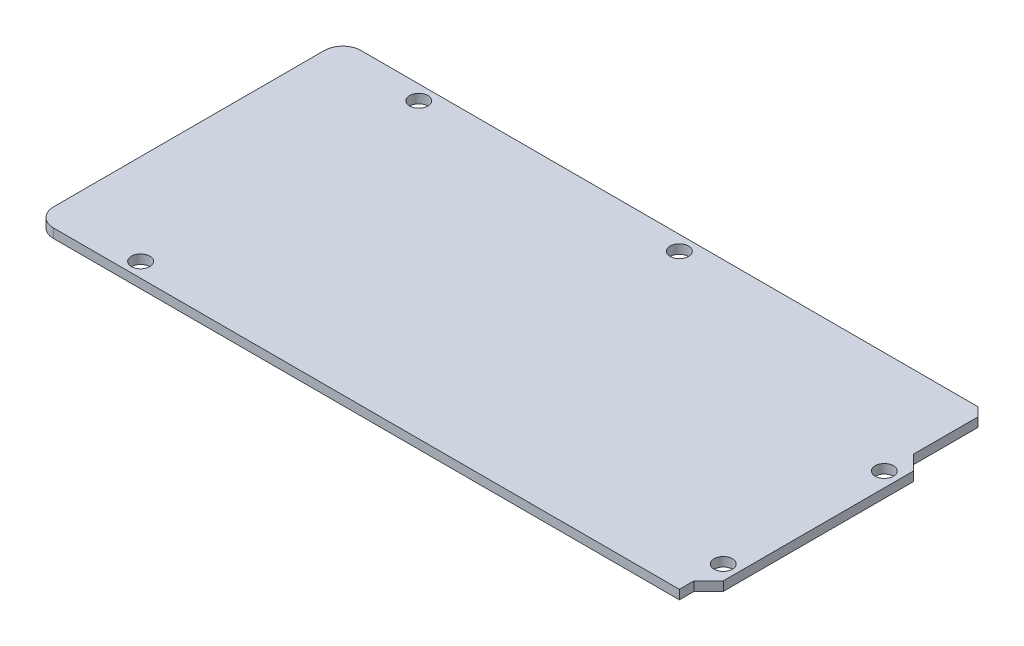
ISO-10303-21;
HEADER;
FILE_DESCRIPTION(('STEP AP214'),'2;1');
FILE_NAME('part.step','',(''),(''),'','','');
FILE_SCHEMA(('AUTOMOTIVE_DESIGN { 1 0 10303 214 1 1 1 1 }'));
ENDSEC;
DATA;
#1=APPLICATION_CONTEXT('core data for automotive mechanical design processes');
#2=APPLICATION_PROTOCOL_DEFINITION('international standard','automotive_design',2000,#1);
#3=PRODUCT_CONTEXT('',#1,'mechanical');
#4=PRODUCT('Part','Part','',(#3));
#5=PRODUCT_RELATED_PRODUCT_CATEGORY('part','',(#4));
#6=PRODUCT_DEFINITION_FORMATION('','',#4);
#7=PRODUCT_DEFINITION_CONTEXT('part definition',#1,'design');
#8=PRODUCT_DEFINITION('design','',#6,#7);
#9=PRODUCT_DEFINITION_SHAPE('','',#8);
#10=(LENGTH_UNIT() NAMED_UNIT(*) SI_UNIT(.MILLI.,.METRE.));
#11=(NAMED_UNIT(*) PLANE_ANGLE_UNIT() SI_UNIT($,.RADIAN.));
#12=(NAMED_UNIT(*) SI_UNIT($,.STERADIAN.) SOLID_ANGLE_UNIT());
#13=UNCERTAINTY_MEASURE_WITH_UNIT(LENGTH_MEASURE(1.E-05),#10,'distance_accuracy_value','');
#14=(GEOMETRIC_REPRESENTATION_CONTEXT(3) GLOBAL_UNCERTAINTY_ASSIGNED_CONTEXT((#13)) GLOBAL_UNIT_ASSIGNED_CONTEXT((#10,
#11,#12)) REPRESENTATION_CONTEXT('',''));
#15=CARTESIAN_POINT('',(0.,0.,0.));
#16=DIRECTION('',(0.,0.,1.));
#17=DIRECTION('',(1.,0.,0.));
#18=AXIS2_PLACEMENT_3D('',#15,#16,#17);
#19=CARTESIAN_POINT('',(3.175,1.5875,-3.175));
#20=DIRECTION('',(0.,-1.,0.));
#21=DIRECTION('',(0.,0.,-1.));
#22=AXIS2_PLACEMENT_3D('',#19,#20,#21);
#23=CYLINDRICAL_SURFACE('',#22,3.175);
#24=CARTESIAN_POINT('',(3.175,0.,-3.175));
#25=DIRECTION('',(0.,1.,0.));
#26=DIRECTION('',(0.,0.,-1.));
#27=AXIS2_PLACEMENT_3D('',#24,#25,#26);
#28=CIRCLE('',#27,3.175);
#29=CARTESIAN_POINT('',(0.,0.,-3.17500000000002));
#30=VERTEX_POINT('',#29);
#31=CARTESIAN_POINT('',(3.17500000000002,0.,0.));
#32=VERTEX_POINT('',#31);
#33=EDGE_CURVE('E145',#30,#32,#28,.T.);
#34=ORIENTED_EDGE('',*,*,#33,.T.);
#35=DIRECTION('',(0.,-1.,0.));
#36=VECTOR('',#35,1.);
#37=CARTESIAN_POINT('',(3.17500000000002,1.5875,0.));
#38=LINE('',#37,#36);
#39=CARTESIAN_POINT('',(3.17500000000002,1.5875,0.));
#40=VERTEX_POINT('',#39);
#41=EDGE_CURVE('E11',#40,#32,#38,.T.);
#42=ORIENTED_EDGE('',*,*,#41,.F.);
#43=CARTESIAN_POINT('',(3.175,1.5875,-3.175));
#44=DIRECTION('',(0.,1.,0.));
#45=DIRECTION('',(0.,0.,-1.));
#46=AXIS2_PLACEMENT_3D('',#43,#44,#45);
#47=CIRCLE('',#46,3.175);
#48=CARTESIAN_POINT('',(0.,1.5875,-3.17500000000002));
#49=VERTEX_POINT('',#48);
#50=EDGE_CURVE('E166',#49,#40,#47,.T.);
#51=ORIENTED_EDGE('',*,*,#50,.F.);
#52=DIRECTION('',(0.,-1.,0.));
#53=VECTOR('',#52,1.);
#54=CARTESIAN_POINT('',(0.,1.5875,-3.17500000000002));
#55=LINE('',#54,#53);
#56=EDGE_CURVE('E141',#49,#30,#55,.T.);
#57=ORIENTED_EDGE('',*,*,#56,.T.);
#58=EDGE_LOOP('',(#34,#42,#51,#57));
#59=FACE_BOUND('',#58,.T.);
#60=ADVANCED_FACE('F31',(#59),#23,.T.);
#61=CARTESIAN_POINT('',(3.17500000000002,1.5875,0.));
#62=DIRECTION('',(0.,0.,-1.));
#63=DIRECTION('',(-1.,0.,0.));
#64=AXIS2_PLACEMENT_3D('',#61,#62,#63);
#65=PLANE('',#64);
#66=DIRECTION('',(1.,0.,0.));
#67=VECTOR('',#66,1.);
#68=CARTESIAN_POINT('',(3.17500000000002,0.,0.));
#69=LINE('',#68,#67);
#70=CARTESIAN_POINT('',(111.76,0.,0.));
#71=VERTEX_POINT('',#70);
#72=EDGE_CURVE('E148',#32,#71,#69,.T.);
#73=ORIENTED_EDGE('',*,*,#72,.T.);
#74=DIRECTION('',(0.,-1.,0.));
#75=VECTOR('',#74,1.);
#76=CARTESIAN_POINT('',(111.76,1.5875,0.));
#77=LINE('',#76,#75);
#78=CARTESIAN_POINT('',(111.76,1.5875,0.));
#79=VERTEX_POINT('',#78);
#80=EDGE_CURVE('E39',#79,#71,#77,.T.);
#81=ORIENTED_EDGE('',*,*,#80,.F.);
#82=DIRECTION('',(1.,0.,0.));
#83=VECTOR('',#82,1.);
#84=CARTESIAN_POINT('',(3.17500000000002,1.5875,0.));
#85=LINE('',#84,#83);
#86=EDGE_CURVE('E99',#40,#79,#85,.T.);
#87=ORIENTED_EDGE('',*,*,#86,.F.);
#88=ORIENTED_EDGE('',*,*,#41,.T.);
#89=EDGE_LOOP('',(#73,#81,#87,#88));
#90=FACE_BOUND('',#89,.T.);
#91=ADVANCED_FACE('F239',(#90),#65,.F.);
#92=CARTESIAN_POINT('',(111.76,1.5875,0.));
#93=DIRECTION('',(-1.,0.,0.));
#94=DIRECTION('',(0.,0.,1.));
#95=AXIS2_PLACEMENT_3D('',#92,#93,#94);
#96=PLANE('',#95);
#97=DIRECTION('',(0.,0.,-1.));
#98=VECTOR('',#97,1.);
#99=CARTESIAN_POINT('',(111.76,0.,0.));
#100=LINE('',#99,#98);
#101=CARTESIAN_POINT('',(111.76,0.,-2.54));
#102=VERTEX_POINT('',#101);
#103=EDGE_CURVE('E151',#71,#102,#100,.T.);
#104=ORIENTED_EDGE('',*,*,#103,.T.);
#105=DIRECTION('',(0.,-1.,0.));
#106=VECTOR('',#105,1.);
#107=CARTESIAN_POINT('',(111.76,1.5875,-2.54));
#108=LINE('',#107,#106);
#109=CARTESIAN_POINT('',(111.76,1.5875,-2.54));
#110=VERTEX_POINT('',#109);
#111=EDGE_CURVE('E182',#110,#102,#108,.T.);
#112=ORIENTED_EDGE('',*,*,#111,.F.);
#113=DIRECTION('',(0.,0.,-1.));
#114=VECTOR('',#113,1.);
#115=CARTESIAN_POINT('',(111.76,1.5875,0.));
#116=LINE('',#115,#114);
#117=EDGE_CURVE('E190',#79,#110,#116,.T.);
#118=ORIENTED_EDGE('',*,*,#117,.F.);
#119=ORIENTED_EDGE('',*,*,#80,.T.);
#120=EDGE_LOOP('',(#104,#112,#118,#119));
#121=FACE_BOUND('',#120,.T.);
#122=ADVANCED_FACE('F188',(#121),#96,.F.);
#123=CARTESIAN_POINT('',(111.76,1.5875,-2.54));
#124=DIRECTION('',(-0.707106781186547,0.,-0.707106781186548));
#125=DIRECTION('',(-0.707106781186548,0.,0.707106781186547));
#126=AXIS2_PLACEMENT_3D('',#123,#124,#125);
#127=PLANE('',#126);
#128=DIRECTION('',(0.707106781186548,0.,-0.707106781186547));
#129=VECTOR('',#128,1.);
#130=CARTESIAN_POINT('',(111.76,0.,-2.54));
#131=LINE('',#130,#129);
#132=CARTESIAN_POINT('',(114.3,0.,-5.08));
#133=VERTEX_POINT('',#132);
#134=EDGE_CURVE('E153',#102,#133,#131,.T.);
#135=ORIENTED_EDGE('',*,*,#134,.T.);
#136=DIRECTION('',(0.,-1.,0.));
#137=VECTOR('',#136,1.);
#138=CARTESIAN_POINT('',(114.3,1.5875,-5.08));
#139=LINE('',#138,#137);
#140=CARTESIAN_POINT('',(114.3,1.5875,-5.08));
#141=VERTEX_POINT('',#140);
#142=EDGE_CURVE('E179',#141,#133,#139,.T.);
#143=ORIENTED_EDGE('',*,*,#142,.F.);
#144=DIRECTION('',(0.707106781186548,0.,-0.707106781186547));
#145=VECTOR('',#144,1.);
#146=CARTESIAN_POINT('',(111.76,1.5875,-2.54));
#147=LINE('',#146,#145);
#148=EDGE_CURVE('E208',#110,#141,#147,.T.);
#149=ORIENTED_EDGE('',*,*,#148,.F.);
#150=ORIENTED_EDGE('',*,*,#111,.T.);
#151=EDGE_LOOP('',(#135,#143,#149,#150));
#152=FACE_BOUND('',#151,.T.);
#153=ADVANCED_FACE('F199',(#152),#127,.F.);
#154=CARTESIAN_POINT('',(114.3,1.5875,-5.08));
#155=DIRECTION('',(-1.,0.,0.));
#156=DIRECTION('',(0.,0.,1.));
#157=AXIS2_PLACEMENT_3D('',#154,#155,#156);
#158=PLANE('',#157);
#159=DIRECTION('',(0.,0.,-1.));
#160=VECTOR('',#159,1.);
#161=CARTESIAN_POINT('',(114.3,0.,-5.08));
#162=LINE('',#161,#160);
#163=CARTESIAN_POINT('',(114.3,0.,-38.1));
#164=VERTEX_POINT('',#163);
#165=EDGE_CURVE('E155',#133,#164,#162,.T.);
#166=ORIENTED_EDGE('',*,*,#165,.T.);
#167=DIRECTION('',(0.,-1.,0.));
#168=VECTOR('',#167,1.);
#169=CARTESIAN_POINT('',(114.3,1.5875,-38.1));
#170=LINE('',#169,#168);
#171=CARTESIAN_POINT('',(114.3,1.5875,-38.1));
#172=VERTEX_POINT('',#171);
#173=EDGE_CURVE('E176',#172,#164,#170,.T.);
#174=ORIENTED_EDGE('',*,*,#173,.F.);
#175=DIRECTION('',(0.,0.,-1.));
#176=VECTOR('',#175,1.);
#177=CARTESIAN_POINT('',(114.3,1.5875,-5.08));
#178=LINE('',#177,#176);
#179=EDGE_CURVE('E205',#141,#172,#178,.T.);
#180=ORIENTED_EDGE('',*,*,#179,.F.);
#181=ORIENTED_EDGE('',*,*,#142,.T.);
#182=EDGE_LOOP('',(#166,#174,#180,#181));
#183=FACE_BOUND('',#182,.T.);
#184=ADVANCED_FACE('F203',(#183),#158,.F.);
#185=CARTESIAN_POINT('',(114.3,1.5875,-38.1));
#186=DIRECTION('',(-0.707106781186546,0.,0.707106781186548));
#187=DIRECTION('',(0.707106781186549,0.,0.707106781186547));
#188=AXIS2_PLACEMENT_3D('',#185,#186,#187);
#189=PLANE('',#188);
#190=DIRECTION('',(-0.707106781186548,0.,-0.707106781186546));
#191=VECTOR('',#190,1.);
#192=CARTESIAN_POINT('',(114.3,0.,-38.1));
#193=LINE('',#192,#191);
#194=CARTESIAN_POINT('',(111.76,0.,-40.64));
#195=VERTEX_POINT('',#194);
#196=EDGE_CURVE('E157',#164,#195,#193,.T.);
#197=ORIENTED_EDGE('',*,*,#196,.T.);
#198=DIRECTION('',(0.,-1.,0.));
#199=VECTOR('',#198,1.);
#200=CARTESIAN_POINT('',(111.76,1.5875,-40.64));
#201=LINE('',#200,#199);
#202=CARTESIAN_POINT('',(111.76,1.5875,-40.64));
#203=VERTEX_POINT('',#202);
#204=EDGE_CURVE('E173',#203,#195,#201,.T.);
#205=ORIENTED_EDGE('',*,*,#204,.F.);
#206=DIRECTION('',(-0.707106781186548,0.,-0.707106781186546));
#207=VECTOR('',#206,1.);
#208=CARTESIAN_POINT('',(114.3,1.5875,-38.1));
#209=LINE('',#208,#207);
#210=EDGE_CURVE('E207',#172,#203,#209,.T.);
#211=ORIENTED_EDGE('',*,*,#210,.F.);
#212=ORIENTED_EDGE('',*,*,#173,.T.);
#213=EDGE_LOOP('',(#197,#205,#211,#212));
#214=FACE_BOUND('',#213,.T.);
#215=ADVANCED_FACE('F252',(#214),#189,.F.);
#216=CARTESIAN_POINT('',(111.76,1.5875,-40.64));
#217=DIRECTION('',(-1.,0.,0.));
#218=DIRECTION('',(0.,0.,1.));
#219=AXIS2_PLACEMENT_3D('',#216,#217,#218);
#220=PLANE('',#219);
#221=DIRECTION('',(0.,0.,-1.));
#222=VECTOR('',#221,1.);
#223=CARTESIAN_POINT('',(111.76,0.,-40.64));
#224=LINE('',#223,#222);
#225=CARTESIAN_POINT('',(111.76,0.,-51.816));
#226=VERTEX_POINT('',#225);
#227=EDGE_CURVE('E159',#195,#226,#224,.T.);
#228=ORIENTED_EDGE('',*,*,#227,.T.);
#229=DIRECTION('',(0.,-1.,0.));
#230=VECTOR('',#229,1.);
#231=CARTESIAN_POINT('',(111.76,1.5875,-51.816));
#232=LINE('',#231,#230);
#233=CARTESIAN_POINT('',(111.76,1.5875,-51.816));
#234=VERTEX_POINT('',#233);
#235=EDGE_CURVE('E170',#234,#226,#232,.T.);
#236=ORIENTED_EDGE('',*,*,#235,.F.);
#237=DIRECTION('',(0.,0.,-1.));
#238=VECTOR('',#237,1.);
#239=CARTESIAN_POINT('',(111.76,1.5875,-40.64));
#240=LINE('',#239,#238);
#241=EDGE_CURVE('E210',#203,#234,#240,.T.);
#242=ORIENTED_EDGE('',*,*,#241,.F.);
#243=ORIENTED_EDGE('',*,*,#204,.T.);
#244=EDGE_LOOP('',(#228,#236,#242,#243));
#245=FACE_BOUND('',#244,.T.);
#246=ADVANCED_FACE('F219',(#245),#220,.F.);
#247=CARTESIAN_POINT('',(111.76,1.5875,-51.816));
#248=DIRECTION('',(-0.707106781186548,0.,0.707106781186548));
#249=DIRECTION('',(0.707106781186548,0.,0.707106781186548));
#250=AXIS2_PLACEMENT_3D('',#247,#248,#249);
#251=PLANE('',#250);
#252=DIRECTION('',(-0.707106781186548,0.,-0.707106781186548));
#253=VECTOR('',#252,1.);
#254=CARTESIAN_POINT('',(111.76,0.,-51.816));
#255=LINE('',#254,#253);
#256=CARTESIAN_POINT('',(110.236,0.,-53.34));
#257=VERTEX_POINT('',#256);
#258=EDGE_CURVE('E161',#226,#257,#255,.T.);
#259=ORIENTED_EDGE('',*,*,#258,.T.);
#260=DIRECTION('',(0.,-1.,0.));
#261=VECTOR('',#260,1.);
#262=CARTESIAN_POINT('',(110.236,1.5875,-53.34));
#263=LINE('',#262,#261);
#264=CARTESIAN_POINT('',(110.236,1.5875,-53.34));
#265=VERTEX_POINT('',#264);
#266=EDGE_CURVE('E136',#265,#257,#263,.T.);
#267=ORIENTED_EDGE('',*,*,#266,.F.);
#268=DIRECTION('',(-0.707106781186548,0.,-0.707106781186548));
#269=VECTOR('',#268,1.);
#270=CARTESIAN_POINT('',(111.76,1.5875,-51.816));
#271=LINE('',#270,#269);
#272=EDGE_CURVE('E127',#234,#265,#271,.T.);
#273=ORIENTED_EDGE('',*,*,#272,.F.);
#274=ORIENTED_EDGE('',*,*,#235,.T.);
#275=EDGE_LOOP('',(#259,#267,#273,#274));
#276=FACE_BOUND('',#275,.T.);
#277=ADVANCED_FACE('F223',(#276),#251,.F.);
#278=CARTESIAN_POINT('',(3.17500000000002,1.5875,-53.34));
#279=DIRECTION('',(0.,0.,1.));
#280=DIRECTION('',(1.,0.,0.));
#281=AXIS2_PLACEMENT_3D('',#278,#279,#280);
#282=PLANE('',#281);
#283=DIRECTION('',(-1.,0.,0.));
#284=VECTOR('',#283,1.);
#285=CARTESIAN_POINT('',(3.17500000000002,0.,-53.34));
#286=LINE('',#285,#284);
#287=CARTESIAN_POINT('',(3.17500000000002,0.,-53.34));
#288=VERTEX_POINT('',#287);
#289=EDGE_CURVE('E135',#257,#288,#286,.T.);
#290=ORIENTED_EDGE('',*,*,#289,.T.);
#291=DIRECTION('',(0.,-1.,0.));
#292=VECTOR('',#291,1.);
#293=CARTESIAN_POINT('',(3.17500000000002,1.5875,-53.34));
#294=LINE('',#293,#292);
#295=CARTESIAN_POINT('',(3.17500000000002,1.5875,-53.34));
#296=VERTEX_POINT('',#295);
#297=EDGE_CURVE('E132',#296,#288,#294,.T.);
#298=ORIENTED_EDGE('',*,*,#297,.F.);
#299=DIRECTION('',(-1.,0.,0.));
#300=VECTOR('',#299,1.);
#301=CARTESIAN_POINT('',(3.17500000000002,1.5875,-53.34));
#302=LINE('',#301,#300);
#303=EDGE_CURVE('E121',#265,#296,#302,.T.);
#304=ORIENTED_EDGE('',*,*,#303,.F.);
#305=ORIENTED_EDGE('',*,*,#266,.T.);
#306=EDGE_LOOP('',(#290,#298,#304,#305));
#307=FACE_BOUND('',#306,.T.);
#308=ADVANCED_FACE('F133',(#307),#282,.F.);
#309=CARTESIAN_POINT('',(3.175,1.5875,-50.165));
#310=DIRECTION('',(0.,-1.,0.));
#311=DIRECTION('',(0.,0.,-1.));
#312=AXIS2_PLACEMENT_3D('',#309,#310,#311);
#313=CYLINDRICAL_SURFACE('',#312,3.175);
#314=CARTESIAN_POINT('',(3.175,0.,-50.165));
#315=DIRECTION('',(0.,1.,0.));
#316=DIRECTION('',(0.,0.,-1.));
#317=AXIS2_PLACEMENT_3D('',#314,#315,#316);
#318=CIRCLE('',#317,3.175);
#319=CARTESIAN_POINT('',(0.,0.,-50.165));
#320=VERTEX_POINT('',#319);
#321=EDGE_CURVE('E85',#288,#320,#318,.T.);
#322=ORIENTED_EDGE('',*,*,#321,.T.);
#323=DIRECTION('',(0.,-1.,0.));
#324=VECTOR('',#323,1.);
#325=CARTESIAN_POINT('',(0.,1.5875,-50.165));
#326=LINE('',#325,#324);
#327=CARTESIAN_POINT('',(0.,1.5875,-50.165));
#328=VERTEX_POINT('',#327);
#329=EDGE_CURVE('E137',#328,#320,#326,.T.);
#330=ORIENTED_EDGE('',*,*,#329,.F.);
#331=CARTESIAN_POINT('',(3.175,1.5875,-50.165));
#332=DIRECTION('',(0.,1.,0.));
#333=DIRECTION('',(0.,0.,-1.));
#334=AXIS2_PLACEMENT_3D('',#331,#332,#333);
#335=CIRCLE('',#334,3.175);
#336=EDGE_CURVE('E125',#296,#328,#335,.T.);
#337=ORIENTED_EDGE('',*,*,#336,.F.);
#338=ORIENTED_EDGE('',*,*,#297,.T.);
#339=EDGE_LOOP('',(#322,#330,#337,#338));
#340=FACE_BOUND('',#339,.T.);
#341=ADVANCED_FACE('F139',(#340),#313,.T.);
#342=CARTESIAN_POINT('',(0.,1.5875,-3.17500000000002));
#343=DIRECTION('',(1.,0.,0.));
#344=DIRECTION('',(0.,0.,-1.));
#345=AXIS2_PLACEMENT_3D('',#342,#343,#344);
#346=PLANE('',#345);
#347=DIRECTION('',(0.,0.,1.));
#348=VECTOR('',#347,1.);
#349=CARTESIAN_POINT('',(0.,0.,-3.17500000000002));
#350=LINE('',#349,#348);
#351=EDGE_CURVE('E91',#320,#30,#350,.T.);
#352=ORIENTED_EDGE('',*,*,#351,.T.);
#353=ORIENTED_EDGE('',*,*,#56,.F.);
#354=DIRECTION('',(0.,0.,1.));
#355=VECTOR('',#354,1.);
#356=CARTESIAN_POINT('',(0.,1.5875,-3.17500000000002));
#357=LINE('',#356,#355);
#358=EDGE_CURVE('E47',#328,#49,#357,.T.);
#359=ORIENTED_EDGE('',*,*,#358,.F.);
#360=ORIENTED_EDGE('',*,*,#329,.T.);
#361=EDGE_LOOP('',(#352,#353,#359,#360));
#362=FACE_BOUND('',#361,.T.);
#363=ADVANCED_FACE('F227',(#362),#346,.F.);
#364=CARTESIAN_POINT('',(3.175,1.5875,-3.175));
#365=DIRECTION('',(0.,-1.,0.));
#366=DIRECTION('',(0.,0.,-1.));
#367=AXIS2_PLACEMENT_3D('',#364,#365,#366);
#368=PLANE('',#367);
#369=CARTESIAN_POINT('',(15.748,1.5875,-50.8));
#370=DIRECTION('',(0.,1.,0.));
#371=DIRECTION('',(0.,0.,1.));
#372=AXIS2_PLACEMENT_3D('',#369,#370,#371);
#373=CIRCLE('',#372,1.58749999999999);
#374=CARTESIAN_POINT('',(15.748,1.5875,-49.2125));
#375=VERTEX_POINT('',#374);
#376=EDGE_CURVE('E347',#375,#375,#373,.T.);
#377=ORIENTED_EDGE('',*,*,#376,.F.);
#378=EDGE_LOOP('',(#377));
#379=FACE_BOUND('',#378,.T.);
#380=CARTESIAN_POINT('',(15.748,1.5875,-2.54));
#381=DIRECTION('',(0.,1.,0.));
#382=DIRECTION('',(0.,0.,1.));
#383=AXIS2_PLACEMENT_3D('',#380,#381,#382);
#384=CIRCLE('',#383,1.58749999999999);
#385=CARTESIAN_POINT('',(15.748,1.5875,-0.952500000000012));
#386=VERTEX_POINT('',#385);
#387=EDGE_CURVE('E349',#386,#386,#384,.T.);
#388=ORIENTED_EDGE('',*,*,#387,.F.);
#389=EDGE_LOOP('',(#388));
#390=FACE_BOUND('',#389,.T.);
#391=CARTESIAN_POINT('',(60.96,1.5875,-50.8));
#392=DIRECTION('',(0.,1.,0.));
#393=DIRECTION('',(0.,0.,1.));
#394=AXIS2_PLACEMENT_3D('',#391,#392,#393);
#395=CIRCLE('',#394,1.58749999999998);
#396=CARTESIAN_POINT('',(60.96,1.5875,-49.2125));
#397=VERTEX_POINT('',#396);
#398=EDGE_CURVE('E357',#397,#397,#395,.T.);
#399=ORIENTED_EDGE('',*,*,#398,.F.);
#400=EDGE_LOOP('',(#399));
#401=FACE_BOUND('',#400,.T.);
#402=CARTESIAN_POINT('',(111.76,1.5875,-35.56));
#403=DIRECTION('',(0.,1.,0.));
#404=DIRECTION('',(0.,0.,1.));
#405=AXIS2_PLACEMENT_3D('',#402,#403,#404);
#406=CIRCLE('',#405,1.58749999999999);
#407=CARTESIAN_POINT('',(111.76,1.5875,-33.9725));
#408=VERTEX_POINT('',#407);
#409=EDGE_CURVE('E363',#408,#408,#406,.T.);
#410=ORIENTED_EDGE('',*,*,#409,.F.);
#411=EDGE_LOOP('',(#410));
#412=FACE_BOUND('',#411,.T.);
#413=CARTESIAN_POINT('',(111.76,1.5875,-7.62));
#414=DIRECTION('',(0.,1.,0.));
#415=DIRECTION('',(0.,0.,1.));
#416=AXIS2_PLACEMENT_3D('',#413,#414,#415);
#417=CIRCLE('',#416,1.58749999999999);
#418=CARTESIAN_POINT('',(111.76,1.5875,-6.03250000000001));
#419=VERTEX_POINT('',#418);
#420=EDGE_CURVE('E369',#419,#419,#417,.T.);
#421=ORIENTED_EDGE('',*,*,#420,.F.);
#422=EDGE_LOOP('',(#421));
#423=FACE_BOUND('',#422,.T.);
#424=ORIENTED_EDGE('',*,*,#50,.T.);
#425=ORIENTED_EDGE('',*,*,#86,.T.);
#426=ORIENTED_EDGE('',*,*,#117,.T.);
#427=ORIENTED_EDGE('',*,*,#148,.T.);
#428=ORIENTED_EDGE('',*,*,#179,.T.);
#429=ORIENTED_EDGE('',*,*,#210,.T.);
#430=ORIENTED_EDGE('',*,*,#241,.T.);
#431=ORIENTED_EDGE('',*,*,#272,.T.);
#432=ORIENTED_EDGE('',*,*,#303,.T.);
#433=ORIENTED_EDGE('',*,*,#336,.T.);
#434=ORIENTED_EDGE('',*,*,#358,.T.);
#435=EDGE_LOOP('',(#424,#425,#426,#427,#428,#429,#430,#431,#432,#433,#434));
#436=FACE_BOUND('',#435,.T.);
#437=ADVANCED_FACE('F123',(#379,#390,#401,#412,#423,#436),#368,.F.);
#438=CARTESIAN_POINT('',(3.175,0.,-3.175));
#439=DIRECTION('',(0.,-1.,0.));
#440=DIRECTION('',(0.,0.,-1.));
#441=AXIS2_PLACEMENT_3D('',#438,#439,#440);
#442=PLANE('',#441);
#443=CARTESIAN_POINT('',(15.748,0.,-50.8));
#444=DIRECTION('',(0.,1.,0.));
#445=DIRECTION('',(0.,0.,1.));
#446=AXIS2_PLACEMENT_3D('',#443,#444,#445);
#447=CIRCLE('',#446,1.5875);
#448=CARTESIAN_POINT('',(15.748,0.,-49.2125));
#449=VERTEX_POINT('',#448);
#450=EDGE_CURVE('E344',#449,#449,#447,.T.);
#451=ORIENTED_EDGE('',*,*,#450,.T.);
#452=EDGE_LOOP('',(#451));
#453=FACE_BOUND('',#452,.T.);
#454=CARTESIAN_POINT('',(15.748,0.,-2.54));
#455=DIRECTION('',(0.,1.,0.));
#456=DIRECTION('',(0.,0.,1.));
#457=AXIS2_PLACEMENT_3D('',#454,#455,#456);
#458=CIRCLE('',#457,1.5875);
#459=CARTESIAN_POINT('',(15.748,0.,-0.952500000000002));
#460=VERTEX_POINT('',#459);
#461=EDGE_CURVE('E354',#460,#460,#458,.T.);
#462=ORIENTED_EDGE('',*,*,#461,.T.);
#463=EDGE_LOOP('',(#462));
#464=FACE_BOUND('',#463,.T.);
#465=CARTESIAN_POINT('',(60.96,0.,-50.8));
#466=DIRECTION('',(0.,1.,0.));
#467=DIRECTION('',(0.,0.,1.));
#468=AXIS2_PLACEMENT_3D('',#465,#466,#467);
#469=CIRCLE('',#468,1.5875);
#470=CARTESIAN_POINT('',(60.96,0.,-49.2125));
#471=VERTEX_POINT('',#470);
#472=EDGE_CURVE('E360',#471,#471,#469,.T.);
#473=ORIENTED_EDGE('',*,*,#472,.T.);
#474=EDGE_LOOP('',(#473));
#475=FACE_BOUND('',#474,.T.);
#476=CARTESIAN_POINT('',(111.76,0.,-35.56));
#477=DIRECTION('',(0.,1.,0.));
#478=DIRECTION('',(0.,0.,1.));
#479=AXIS2_PLACEMENT_3D('',#476,#477,#478);
#480=CIRCLE('',#479,1.58749999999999);
#481=CARTESIAN_POINT('',(111.76,0.,-33.9725));
#482=VERTEX_POINT('',#481);
#483=EDGE_CURVE('E366',#482,#482,#480,.T.);
#484=ORIENTED_EDGE('',*,*,#483,.T.);
#485=EDGE_LOOP('',(#484));
#486=FACE_BOUND('',#485,.T.);
#487=CARTESIAN_POINT('',(111.76,0.,-7.62));
#488=DIRECTION('',(0.,1.,0.));
#489=DIRECTION('',(0.,0.,1.));
#490=AXIS2_PLACEMENT_3D('',#487,#488,#489);
#491=CIRCLE('',#490,1.58749999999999);
#492=CARTESIAN_POINT('',(111.76,0.,-6.03250000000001));
#493=VERTEX_POINT('',#492);
#494=EDGE_CURVE('E149',#493,#493,#491,.T.);
#495=ORIENTED_EDGE('',*,*,#494,.T.);
#496=EDGE_LOOP('',(#495));
#497=FACE_BOUND('',#496,.T.);
#498=ORIENTED_EDGE('',*,*,#33,.F.);
#499=ORIENTED_EDGE('',*,*,#351,.F.);
#500=ORIENTED_EDGE('',*,*,#321,.F.);
#501=ORIENTED_EDGE('',*,*,#289,.F.);
#502=ORIENTED_EDGE('',*,*,#258,.F.);
#503=ORIENTED_EDGE('',*,*,#227,.F.);
#504=ORIENTED_EDGE('',*,*,#196,.F.);
#505=ORIENTED_EDGE('',*,*,#165,.F.);
#506=ORIENTED_EDGE('',*,*,#134,.F.);
#507=ORIENTED_EDGE('',*,*,#103,.F.);
#508=ORIENTED_EDGE('',*,*,#72,.F.);
#509=EDGE_LOOP('',(#498,#499,#500,#501,#502,#503,#504,#505,#506,#507,#508));
#510=FACE_BOUND('',#509,.T.);
#511=ADVANCED_FACE('F194',(#453,#464,#475,#486,#497,#510),#442,.T.);
#512=CARTESIAN_POINT('',(111.76,1.5875,-7.62));
#513=DIRECTION('',(0.,1.,0.));
#514=DIRECTION('',(0.,0.,1.));
#515=AXIS2_PLACEMENT_3D('',#512,#513,#514);
#516=CYLINDRICAL_SURFACE('',#515,1.58749999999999);
#517=ORIENTED_EDGE('',*,*,#494,.F.);
#518=EDGE_LOOP('',(#517));
#519=FACE_BOUND('',#518,.T.);
#520=ORIENTED_EDGE('',*,*,#420,.T.);
#521=EDGE_LOOP('',(#520));
#522=FACE_BOUND('',#521,.T.);
#523=ADVANCED_FACE('F288',(#519,#522),#516,.F.);
#524=CARTESIAN_POINT('',(111.76,1.5875,-35.56));
#525=DIRECTION('',(0.,1.,0.));
#526=DIRECTION('',(0.,0.,1.));
#527=AXIS2_PLACEMENT_3D('',#524,#525,#526);
#528=CYLINDRICAL_SURFACE('',#527,1.58749999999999);
#529=ORIENTED_EDGE('',*,*,#483,.F.);
#530=EDGE_LOOP('',(#529));
#531=FACE_BOUND('',#530,.T.);
#532=ORIENTED_EDGE('',*,*,#409,.T.);
#533=EDGE_LOOP('',(#532));
#534=FACE_BOUND('',#533,.T.);
#535=ADVANCED_FACE('F297',(#531,#534),#528,.F.);
#536=CARTESIAN_POINT('',(60.96,1.5875,-50.8));
#537=DIRECTION('',(0.,1.,0.));
#538=DIRECTION('',(0.,0.,1.));
#539=AXIS2_PLACEMENT_3D('',#536,#537,#538);
#540=CYLINDRICAL_SURFACE('',#539,1.58749999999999);
#541=ORIENTED_EDGE('',*,*,#472,.F.);
#542=EDGE_LOOP('',(#541));
#543=FACE_BOUND('',#542,.T.);
#544=ORIENTED_EDGE('',*,*,#398,.T.);
#545=EDGE_LOOP('',(#544));
#546=FACE_BOUND('',#545,.T.);
#547=ADVANCED_FACE('F307',(#543,#546),#540,.F.);
#548=CARTESIAN_POINT('',(15.748,1.5875,-2.54));
#549=DIRECTION('',(0.,1.,0.));
#550=DIRECTION('',(0.,0.,1.));
#551=AXIS2_PLACEMENT_3D('',#548,#549,#550);
#552=CYLINDRICAL_SURFACE('',#551,1.58749999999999);
#553=ORIENTED_EDGE('',*,*,#461,.F.);
#554=EDGE_LOOP('',(#553));
#555=FACE_BOUND('',#554,.T.);
#556=ORIENTED_EDGE('',*,*,#387,.T.);
#557=EDGE_LOOP('',(#556));
#558=FACE_BOUND('',#557,.T.);
#559=ADVANCED_FACE('F317',(#555,#558),#552,.F.);
#560=CARTESIAN_POINT('',(15.748,1.5875,-50.8));
#561=DIRECTION('',(0.,1.,0.));
#562=DIRECTION('',(0.,0.,1.));
#563=AXIS2_PLACEMENT_3D('',#560,#561,#562);
#564=CYLINDRICAL_SURFACE('',#563,1.58749999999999);
#565=ORIENTED_EDGE('',*,*,#450,.F.);
#566=EDGE_LOOP('',(#565));
#567=FACE_BOUND('',#566,.T.);
#568=ORIENTED_EDGE('',*,*,#376,.T.);
#569=EDGE_LOOP('',(#568));
#570=FACE_BOUND('',#569,.T.);
#571=ADVANCED_FACE('F327',(#567,#570),#564,.F.);
#572=CLOSED_SHELL('',(#60,#91,#122,#153,#184,#215,#246,#277,#308,#341,#363,#437,#511,#523,#535,
#547,#559,#571));
#573=MANIFOLD_SOLID_BREP('B2',#572);
#574=ADVANCED_BREP_SHAPE_REPRESENTATION('',(#18,#573),#14);
#575=SHAPE_DEFINITION_REPRESENTATION(#9,#574);
ENDSEC;
END-ISO-10303-21;
